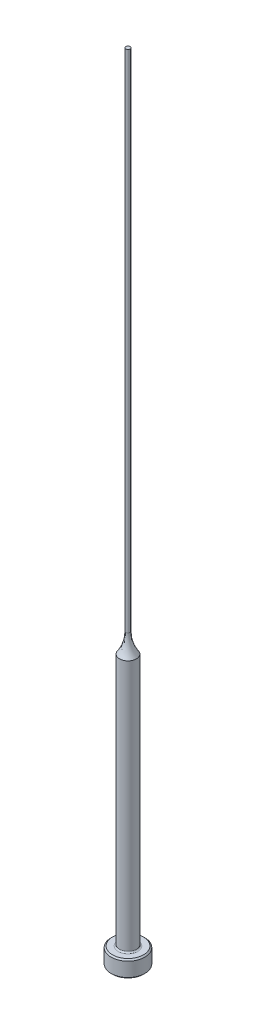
from build123d import *

# Parameters (mm, degrees)
CHAMFER1_SIZE = 0.254
FILLET1_R     = 0.254


with BuildPart() as part:
    # Sketch1 → Revolve1 (revolve)
    with BuildSketch(Plane.XY, mode=Mode.PRIVATE) as revolve1_sk:
        with BuildLine():
            Line((0, 0), (-3.175, 0))
            Line((-3.175, 0), (-3.175, 3.175))
            Line((-3.175, 3.175), (-1.5875, 3.175))
            Line((-1.5875, 3.175), (-1.5875, 50.8))
            ThreePointArc((-1.5875, 50.8), (-0.701386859, 52.557887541), (-0.39624, 54.50268843))
            Line((-0.39624, 54.50268843), (-0.39624, 149.733))
            Line((-0.39624, 149.733), (0, 149.733))
            Line((0, 149.733), (0, 0))
        make_face()
    revolve(revolve1_sk.sketch.rotate(Axis((0, 259.958771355, 0), (0, -1, 0)), 270), axis=Axis((0, 259.958771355, 0), (0, -1, 0)))

    # Chamfer1
    chamfer1_edges = [part.edges().sort_by_distance(p)[0] for p in [
        (0, 0, -3.175),
        (0, 3.175, -3.175),
    ]]
    chamfer(chamfer1_edges, length=CHAMFER1_SIZE)

    # Fillet1
    fillet1_edges = [part.edges().sort_by_distance(p)[0] for p in [
        (0, 3.175, -1.5875),
    ]]
    fillet(fillet1_edges, radius=FILLET1_R)


solid = part.part
